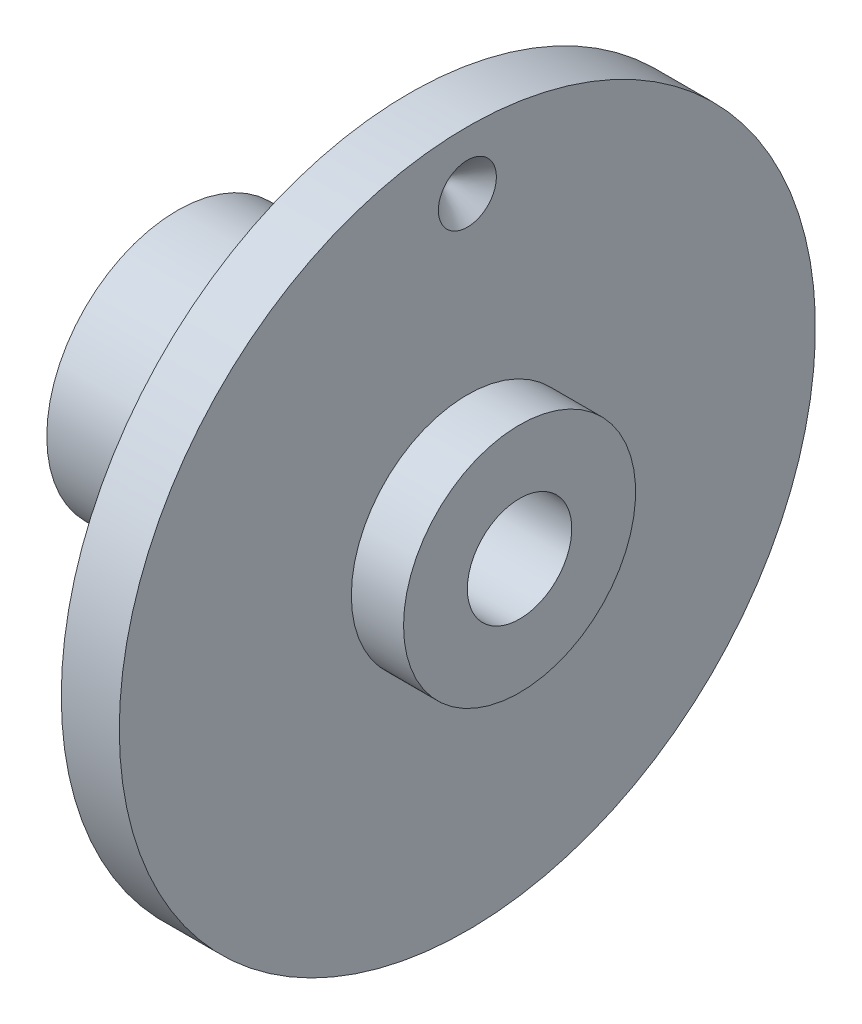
ISO-10303-21;
HEADER;
FILE_DESCRIPTION(('STEP AP214'),'2;1');
FILE_NAME('part.step','',(''),(''),'','','');
FILE_SCHEMA(('AUTOMOTIVE_DESIGN { 1 0 10303 214 1 1 1 1 }'));
ENDSEC;
DATA;
#1=APPLICATION_CONTEXT('core data for automotive mechanical design processes');
#2=APPLICATION_PROTOCOL_DEFINITION('international standard','automotive_design',2000,#1);
#3=PRODUCT_CONTEXT('',#1,'mechanical');
#4=PRODUCT('Part','Part','',(#3));
#5=PRODUCT_RELATED_PRODUCT_CATEGORY('part','',(#4));
#6=PRODUCT_DEFINITION_FORMATION('','',#4);
#7=PRODUCT_DEFINITION_CONTEXT('part definition',#1,'design');
#8=PRODUCT_DEFINITION('design','',#6,#7);
#9=PRODUCT_DEFINITION_SHAPE('','',#8);
#10=(LENGTH_UNIT() NAMED_UNIT(*) SI_UNIT(.MILLI.,.METRE.));
#11=(NAMED_UNIT(*) PLANE_ANGLE_UNIT() SI_UNIT($,.RADIAN.));
#12=(NAMED_UNIT(*) SI_UNIT($,.STERADIAN.) SOLID_ANGLE_UNIT());
#13=UNCERTAINTY_MEASURE_WITH_UNIT(LENGTH_MEASURE(1.E-05),#10,'distance_accuracy_value','');
#14=(GEOMETRIC_REPRESENTATION_CONTEXT(3) GLOBAL_UNCERTAINTY_ASSIGNED_CONTEXT((#13)) GLOBAL_UNIT_ASSIGNED_CONTEXT((#10,
#11,#12)) REPRESENTATION_CONTEXT('',''));
#15=CARTESIAN_POINT('',(0.,0.,0.));
#16=DIRECTION('',(0.,0.,1.));
#17=DIRECTION('',(1.,0.,0.));
#18=AXIS2_PLACEMENT_3D('',#15,#16,#17);
#19=CARTESIAN_POINT('',(50.,20.,0.));
#20=DIRECTION('',(-1.,0.,0.));
#21=DIRECTION('',(0.,0.,1.));
#22=AXIS2_PLACEMENT_3D('',#19,#20,#21);
#23=PLANE('',#22);
#24=CARTESIAN_POINT('',(50.,0.,0.));
#25=DIRECTION('',(-1.,0.,0.));
#26=DIRECTION('',(0.,0.,1.));
#27=AXIS2_PLACEMENT_3D('',#24,#25,#26);
#28=CIRCLE('',#27,20.);
#29=CARTESIAN_POINT('',(50.,0.,20.));
#30=VERTEX_POINT('',#29);
#31=EDGE_CURVE('E76',#30,#30,#28,.T.);
#32=ORIENTED_EDGE('',*,*,#31,.T.);
#33=EDGE_LOOP('',(#32));
#34=FACE_BOUND('',#33,.T.);
#35=CARTESIAN_POINT('',(50.,0.,0.));
#36=DIRECTION('',(-1.,0.,0.));
#37=DIRECTION('',(0.,0.,1.));
#38=AXIS2_PLACEMENT_3D('',#35,#36,#37);
#39=CIRCLE('',#38,60.);
#40=CARTESIAN_POINT('',(50.,0.,60.));
#41=VERTEX_POINT('',#40);
#42=EDGE_CURVE('E79',#41,#41,#39,.T.);
#43=ORIENTED_EDGE('',*,*,#42,.F.);
#44=EDGE_LOOP('',(#43));
#45=FACE_BOUND('',#44,.T.);
#46=CARTESIAN_POINT('',(50.,50.,0.));
#47=DIRECTION('',(-1.,0.,0.));
#48=DIRECTION('',(0.,0.,1.));
#49=AXIS2_PLACEMENT_3D('',#46,#47,#48);
#50=CIRCLE('',#49,5.00000000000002);
#51=CARTESIAN_POINT('',(50.,50.,5.00000000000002));
#52=VERTEX_POINT('',#51);
#53=EDGE_CURVE('E56',#52,#52,#50,.T.);
#54=ORIENTED_EDGE('',*,*,#53,.T.);
#55=EDGE_LOOP('',(#54));
#56=FACE_BOUND('',#55,.T.);
#57=ADVANCED_FACE('F32',(#34,#45,#56),#23,.F.);
#58=CARTESIAN_POINT('',(0.,22.5,0.));
#59=DIRECTION('',(1.,0.,0.));
#60=DIRECTION('',(0.,0.,-1.));
#61=AXIS2_PLACEMENT_3D('',#58,#59,#60);
#62=PLANE('',#61);
#63=CARTESIAN_POINT('',(0.,0.,0.));
#64=DIRECTION('',(-1.,0.,0.));
#65=DIRECTION('',(0.,0.,1.));
#66=AXIS2_PLACEMENT_3D('',#63,#64,#65);
#67=CIRCLE('',#66,9.);
#68=CARTESIAN_POINT('',(0.,0.,9.));
#69=VERTEX_POINT('',#68);
#70=EDGE_CURVE('E58',#69,#69,#67,.T.);
#71=ORIENTED_EDGE('',*,*,#70,.F.);
#72=EDGE_LOOP('',(#71));
#73=FACE_BOUND('',#72,.T.);
#74=CARTESIAN_POINT('',(0.,0.,0.));
#75=DIRECTION('',(-1.,0.,0.));
#76=DIRECTION('',(0.,0.,1.));
#77=AXIS2_PLACEMENT_3D('',#74,#75,#76);
#78=CIRCLE('',#77,22.5);
#79=CARTESIAN_POINT('',(0.,0.,22.5));
#80=VERTEX_POINT('',#79);
#81=EDGE_CURVE('E11',#80,#80,#78,.T.);
#82=ORIENTED_EDGE('',*,*,#81,.T.);
#83=EDGE_LOOP('',(#82));
#84=FACE_BOUND('',#83,.T.);
#85=ADVANCED_FACE('F34',(#73,#84),#62,.F.);
#86=CARTESIAN_POINT('',(-20.,0.,0.));
#87=DIRECTION('',(-1.,0.,0.));
#88=DIRECTION('',(0.,0.,1.));
#89=AXIS2_PLACEMENT_3D('',#86,#87,#88);
#90=CYLINDRICAL_SURFACE('',#89,22.5);
#91=CARTESIAN_POINT('',(15.,13.0770155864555,-18.3096057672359));
#92=CARTESIAN_POINT('',(15.206317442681,13.0770240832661,-18.3096024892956));
#93=CARTESIAN_POINT('',(15.4127485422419,13.0913156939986,-18.2994183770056));
#94=CARTESIAN_POINT('',(15.8198215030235,13.1479095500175,-18.2587962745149));
#95=CARTESIAN_POINT('',(16.0204578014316,13.1902378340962,-18.2283394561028));
#96=CARTESIAN_POINT('',(16.4099908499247,13.3010860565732,-18.1476108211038));
#97=CARTESIAN_POINT('',(16.5988971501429,13.3695843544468,-18.0973553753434));
#98=CARTESIAN_POINT('',(16.9599180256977,13.5300092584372,-17.9777310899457));
#99=CARTESIAN_POINT('',(17.1320345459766,13.6219331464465,-17.9083644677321));
#100=CARTESIAN_POINT('',(17.456263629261,13.8265960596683,-17.750831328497));
#101=CARTESIAN_POINT('',(17.608191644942,13.9395071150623,-17.6625084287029));
#102=CARTESIAN_POINT('',(17.8861286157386,14.1814786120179,-17.4688189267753));
#103=CARTESIAN_POINT('',(18.0121360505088,14.3105400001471,-17.3634513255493));
#104=CARTESIAN_POINT('',(18.2353460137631,14.581076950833,-17.1369033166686));
#105=CARTESIAN_POINT('',(18.3323770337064,14.7226202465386,-17.0156346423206));
#106=CARTESIAN_POINT('',(18.4937776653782,15.0126327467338,-16.7603143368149));
#107=CARTESIAN_POINT('',(18.5581493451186,15.1611015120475,-16.6262635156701));
#108=CARTESIAN_POINT('',(18.6518402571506,15.4587399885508,-16.3498689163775));
#109=CARTESIAN_POINT('',(18.6814694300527,15.6078913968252,-16.2076105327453));
#110=CARTESIAN_POINT('',(18.7057978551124,15.9036103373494,-15.9175394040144));
#111=CARTESIAN_POINT('',(18.7004994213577,16.0501780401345,-15.769727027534));
#112=CARTESIAN_POINT('',(18.6553651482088,16.335150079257,-15.4743208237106));
#113=CARTESIAN_POINT('',(18.6158628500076,16.4736195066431,-15.3267386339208));
#114=CARTESIAN_POINT('',(18.5039671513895,16.7403955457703,-15.0349017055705));
#115=CARTESIAN_POINT('',(18.4315727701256,16.8687018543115,-14.8906470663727));
#116=CARTESIAN_POINT('',(18.2556150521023,17.1128168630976,-14.6094611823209));
#117=CARTESIAN_POINT('',(18.151913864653,17.2285671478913,-14.4725655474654));
#118=CARTESIAN_POINT('',(17.916387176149,17.4446469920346,-14.2113710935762));
#119=CARTESIAN_POINT('',(17.7845594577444,17.544975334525,-14.0870732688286));
#120=CARTESIAN_POINT('',(17.4946707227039,17.7295824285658,-13.8540358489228));
#121=CARTESIAN_POINT('',(17.3363182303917,17.8136576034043,-13.745497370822));
#122=CARTESIAN_POINT('',(16.9988582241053,17.9629552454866,-13.5498130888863));
#123=CARTESIAN_POINT('',(16.8197505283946,18.0281775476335,-13.4626674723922));
#124=CARTESIAN_POINT('',(16.4455371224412,18.138885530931,-13.3131340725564));
#125=CARTESIAN_POINT('',(16.2504145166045,18.1843500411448,-13.2507728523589));
#126=CARTESIAN_POINT('',(15.8498914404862,18.2547937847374,-13.1535600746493));
#127=CARTESIAN_POINT('',(15.6444918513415,18.2797747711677,-13.1187061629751));
#128=CARTESIAN_POINT('',(15.2318037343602,18.3087352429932,-13.0782580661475));
#129=CARTESIAN_POINT('',(15.0245649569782,18.3129555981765,-13.07232830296));
#130=CARTESIAN_POINT('',(14.6118467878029,18.300989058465,-13.0890756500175));
#131=CARTESIAN_POINT('',(14.4063673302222,18.2848029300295,-13.1117516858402));
#132=CARTESIAN_POINT('',(14.0042909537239,18.2324112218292,-13.1845041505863));
#133=CARTESIAN_POINT('',(13.8076472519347,18.1963291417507,-13.2344115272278));
#134=CARTESIAN_POINT('',(13.4273408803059,18.1047212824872,-13.3594550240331));
#135=CARTESIAN_POINT('',(13.2436789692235,18.0491943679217,-13.4345926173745));
#136=CARTESIAN_POINT('',(12.8927337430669,17.918874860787,-13.6079293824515));
#137=CARTESIAN_POINT('',(12.7256124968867,17.8439135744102,-13.7063297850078));
#138=CARTESIAN_POINT('',(12.4141667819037,17.6760719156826,-13.9221090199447));
#139=CARTESIAN_POINT('',(12.2698438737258,17.5831903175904,-14.0394891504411));
#140=CARTESIAN_POINT('',(12.006606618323,17.3799857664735,-14.2902888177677));
#141=CARTESIAN_POINT('',(11.8879638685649,17.2694959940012,-14.423858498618));
#142=CARTESIAN_POINT('',(11.6813557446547,17.0338530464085,-14.7013924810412));
#143=CARTESIAN_POINT('',(11.5933893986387,16.9087003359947,-14.8453564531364));
#144=CARTESIAN_POINT('',(11.4510553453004,16.6470296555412,-15.1381887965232));
#145=CARTESIAN_POINT('',(11.3965446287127,16.5105629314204,-15.2870333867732));
#146=CARTESIAN_POINT('',(11.3222083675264,16.229201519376,-15.585411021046));
#147=CARTESIAN_POINT('',(11.3023800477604,16.084307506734,-15.7349440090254));
#148=CARTESIAN_POINT('',(11.2980496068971,15.791859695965,-16.0283991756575));
#149=CARTESIAN_POINT('',(11.3131339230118,15.6443573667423,-16.1723667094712));
#150=CARTESIAN_POINT('',(11.3773071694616,15.3494116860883,-16.4525666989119));
#151=CARTESIAN_POINT('',(11.4263959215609,15.2019683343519,-16.5887991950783));
#152=CARTESIAN_POINT('',(11.5570275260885,14.9119016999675,-16.8500230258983));
#153=CARTESIAN_POINT('',(11.6385361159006,14.7692735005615,-16.9750260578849));
#154=CARTESIAN_POINT('',(11.8316479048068,14.4932937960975,-17.2112600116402));
#155=CARTESIAN_POINT('',(11.9432524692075,14.359942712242,-17.3224903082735));
#156=CARTESIAN_POINT('',(12.1948583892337,14.1055852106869,-17.530253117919));
#157=CARTESIAN_POINT('',(12.335162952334,13.9847332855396,-17.6266076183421));
#158=CARTESIAN_POINT('',(12.6395494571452,13.7614013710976,-17.8015169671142));
#159=CARTESIAN_POINT('',(12.8036369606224,13.6589256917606,-17.8800676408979));
#160=CARTESIAN_POINT('',(13.1522675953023,13.4756120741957,-18.0186351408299));
#161=CARTESIAN_POINT('',(13.3369434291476,13.394927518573,-18.0785210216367));
#162=CARTESIAN_POINT('',(13.7205354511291,13.2594608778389,-18.1781139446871));
#163=CARTESIAN_POINT('',(13.9194371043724,13.2046527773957,-18.2178412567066));
#164=CARTESIAN_POINT('',(14.2659419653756,13.1351466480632,-18.2679810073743));
#165=CARTESIAN_POINT('',(14.4114409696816,13.1133944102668,-18.2835775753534));
#166=CARTESIAN_POINT('',(14.704607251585,13.0843259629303,-18.3043910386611));
#167=CARTESIAN_POINT('',(14.8522744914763,13.0770095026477,-18.3096081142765));
#168=CARTESIAN_POINT('',(15.,13.0770155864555,-18.3096057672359));
#169=B_SPLINE_CURVE_WITH_KNOTS('',3,(#91,#92,#93,#94,#95,#96,#97,#98,#99,#100,#101,#102,#103,
#104,#105,#106,#107,#108,#109,#110,#111,#112,#113,#114,#115,#116,#117,#118,#119,#120,#121,#122,
#123,#124,#125,#126,#127,#128,#129,#130,#131,#132,#133,#134,#135,#136,#137,#138,#139,#140,#141,
#142,#143,#144,#145,#146,#147,#148,#149,#150,#151,#152,#153,#154,#155,#156,#157,#158,#159,#160,
#161,#162,#163,#164,#165,#166,#167,#168),.UNSPECIFIED.,.T.,.F.,(4,2,2,2,2,2,2,2,2,2,2,2,2,2,2,2,
2,2,2,2,2,2,2,2,2,2,2,2,2,2,2,2,2,2,2,2,2,2,4),(0.,0.618412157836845,1.23739946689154,
1.85587602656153,2.47428085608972,3.09799813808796,3.72175199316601,4.34912776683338,
4.97646380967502,5.59815970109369,6.21981440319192,6.83547441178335,7.45115278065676,
8.06958266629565,8.68806132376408,9.3138454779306,9.93963511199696,10.5660936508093,
11.1924985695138,11.8116183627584,12.4307149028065,13.0460111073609,13.661343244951,
14.2822066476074,14.9031125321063,15.5302950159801,16.1574576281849,16.7819203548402,
17.4063331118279,18.0233872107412,18.6404380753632,19.2568385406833,19.873266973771,
20.4965794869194,21.1200380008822,21.7477768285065,22.3748831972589,22.8176806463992,
23.2604704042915),.UNSPECIFIED.);
#170=CARTESIAN_POINT('',(15.,13.0770155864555,-18.3096057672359));
#171=VERTEX_POINT('',#170);
#172=EDGE_CURVE('E59',#171,#171,#169,.T.);
#173=ORIENTED_EDGE('',*,*,#172,.T.);
#174=EDGE_LOOP('',(#173));
#175=FACE_BOUND('',#174,.T.);
#176=CARTESIAN_POINT('',(15.,-18.309605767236,13.0770155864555));
#177=CARTESIAN_POINT('',(14.793682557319,-18.3096024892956,13.0770240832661));
#178=CARTESIAN_POINT('',(14.587251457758,-18.2994183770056,13.0913156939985));
#179=CARTESIAN_POINT('',(14.1801784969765,-18.258796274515,13.1479095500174));
#180=CARTESIAN_POINT('',(13.9795421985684,-18.2283394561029,13.1902378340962));
#181=CARTESIAN_POINT('',(13.5900091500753,-18.1476108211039,13.3010860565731));
#182=CARTESIAN_POINT('',(13.4011028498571,-18.0973553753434,13.3695843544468));
#183=CARTESIAN_POINT('',(13.0400819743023,-17.9777310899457,13.5300092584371));
#184=CARTESIAN_POINT('',(12.8679654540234,-17.9083644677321,13.6219331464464));
#185=CARTESIAN_POINT('',(12.543736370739,-17.7508313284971,13.8265960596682));
#186=CARTESIAN_POINT('',(12.391808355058,-17.6625084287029,13.9395071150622));
#187=CARTESIAN_POINT('',(12.1138713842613,-17.4688189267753,14.1814786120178));
#188=CARTESIAN_POINT('',(11.9878639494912,-17.3634513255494,14.3105400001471));
#189=CARTESIAN_POINT('',(11.7646539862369,-17.1369033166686,14.581076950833));
#190=CARTESIAN_POINT('',(11.6676229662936,-17.0156346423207,14.7226202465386));
#191=CARTESIAN_POINT('',(11.5062223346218,-16.760314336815,15.0126327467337));
#192=CARTESIAN_POINT('',(11.4418506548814,-16.6262635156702,15.1611015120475));
#193=CARTESIAN_POINT('',(11.3481597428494,-16.3498689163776,15.4587399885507));
#194=CARTESIAN_POINT('',(11.3185305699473,-16.2076105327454,15.6078913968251));
#195=CARTESIAN_POINT('',(11.2942021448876,-15.9175394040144,15.9036103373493));
#196=CARTESIAN_POINT('',(11.2995005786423,-15.7697270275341,16.0501780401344));
#197=CARTESIAN_POINT('',(11.3446348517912,-15.4743208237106,16.3351500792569));
#198=CARTESIAN_POINT('',(11.3841371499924,-15.3267386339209,16.473619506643));
#199=CARTESIAN_POINT('',(11.4960328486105,-15.0349017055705,16.7403955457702));
#200=CARTESIAN_POINT('',(11.5684272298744,-14.8906470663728,16.8687018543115));
#201=CARTESIAN_POINT('',(11.7443849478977,-14.6094611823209,17.1128168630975));
#202=CARTESIAN_POINT('',(11.848086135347,-14.4725655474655,17.2285671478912));
#203=CARTESIAN_POINT('',(12.083612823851,-14.2113710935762,17.4446469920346));
#204=CARTESIAN_POINT('',(12.2154405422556,-14.0870732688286,17.5449753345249));
#205=CARTESIAN_POINT('',(12.5053292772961,-13.8540358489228,17.7295824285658));
#206=CARTESIAN_POINT('',(12.6636817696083,-13.745497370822,17.8136576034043));
#207=CARTESIAN_POINT('',(13.0011417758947,-13.5498130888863,17.9629552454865));
#208=CARTESIAN_POINT('',(13.1802494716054,-13.4626674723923,18.0281775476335));
#209=CARTESIAN_POINT('',(13.5544628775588,-13.3131340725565,18.138885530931));
#210=CARTESIAN_POINT('',(13.7495854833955,-13.250772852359,18.1843500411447));
#211=CARTESIAN_POINT('',(14.1501085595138,-13.1535600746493,18.2547937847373));
#212=CARTESIAN_POINT('',(14.3555081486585,-13.1187061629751,18.2797747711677));
#213=CARTESIAN_POINT('',(14.7681962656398,-13.0782580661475,18.3087352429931));
#214=CARTESIAN_POINT('',(14.9754350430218,-13.0723283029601,18.3129555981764));
#215=CARTESIAN_POINT('',(15.3881532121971,-13.0890756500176,18.3009890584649));
#216=CARTESIAN_POINT('',(15.5936326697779,-13.1117516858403,18.2848029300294));
#217=CARTESIAN_POINT('',(15.9957090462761,-13.1845041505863,18.2324112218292));
#218=CARTESIAN_POINT('',(16.1923527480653,-13.2344115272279,18.1963291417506));
#219=CARTESIAN_POINT('',(16.5726591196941,-13.3594550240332,18.1047212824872));
#220=CARTESIAN_POINT('',(16.7563210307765,-13.4345926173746,18.0491943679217));
#221=CARTESIAN_POINT('',(17.1072662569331,-13.6079293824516,17.918874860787));
#222=CARTESIAN_POINT('',(17.2743875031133,-13.7063297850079,17.8439135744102));
#223=CARTESIAN_POINT('',(17.5858332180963,-13.9221090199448,17.6760719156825));
#224=CARTESIAN_POINT('',(17.7301561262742,-14.0394891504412,17.5831903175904));
#225=CARTESIAN_POINT('',(17.993393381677,-14.2902888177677,17.3799857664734));
#226=CARTESIAN_POINT('',(18.1120361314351,-14.4238584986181,17.2694959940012));
#227=CARTESIAN_POINT('',(18.3186442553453,-14.7013924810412,17.0338530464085));
#228=CARTESIAN_POINT('',(18.4066106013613,-14.8453564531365,16.9087003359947));
#229=CARTESIAN_POINT('',(18.5489446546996,-15.1381887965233,16.6470296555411));
#230=CARTESIAN_POINT('',(18.6034553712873,-15.2870333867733,16.5105629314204));
#231=CARTESIAN_POINT('',(18.6777916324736,-15.5854110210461,16.2292015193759));
#232=CARTESIAN_POINT('',(18.6976199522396,-15.7349440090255,16.0843075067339));
#233=CARTESIAN_POINT('',(18.7019503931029,-16.0283991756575,15.7918596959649));
#234=CARTESIAN_POINT('',(18.6868660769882,-16.1723667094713,15.6443573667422));
#235=CARTESIAN_POINT('',(18.6226928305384,-16.452566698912,15.3494116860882));
#236=CARTESIAN_POINT('',(18.5736040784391,-16.5887991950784,15.2019683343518));
#237=CARTESIAN_POINT('',(18.4429724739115,-16.8500230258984,14.9119016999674));
#238=CARTESIAN_POINT('',(18.3614638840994,-16.975026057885,14.7692735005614));
#239=CARTESIAN_POINT('',(18.1683520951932,-17.2112600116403,14.4932937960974));
#240=CARTESIAN_POINT('',(18.0567475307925,-17.3224903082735,14.359942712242));
#241=CARTESIAN_POINT('',(17.8051416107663,-17.530253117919,14.1055852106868));
#242=CARTESIAN_POINT('',(17.664837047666,-17.6266076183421,13.9847332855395));
#243=CARTESIAN_POINT('',(17.3604505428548,-17.8015169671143,13.7614013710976));
#244=CARTESIAN_POINT('',(17.1963630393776,-17.8800676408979,13.6589256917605));
#245=CARTESIAN_POINT('',(16.8477324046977,-18.0186351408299,13.4756120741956));
#246=CARTESIAN_POINT('',(16.6630565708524,-18.0785210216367,13.3949275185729));
#247=CARTESIAN_POINT('',(16.2794645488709,-18.1781139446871,13.2594608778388));
#248=CARTESIAN_POINT('',(16.0805628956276,-18.2178412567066,13.2046527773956));
#249=CARTESIAN_POINT('',(15.7340580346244,-18.2679810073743,13.1351466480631));
#250=CARTESIAN_POINT('',(15.5885590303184,-18.2835775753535,13.1133944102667));
#251=CARTESIAN_POINT('',(15.295392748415,-18.3043910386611,13.0843259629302));
#252=CARTESIAN_POINT('',(15.1477255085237,-18.3096081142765,13.0770095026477));
#253=CARTESIAN_POINT('',(15.,-18.309605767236,13.0770155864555));
#254=B_SPLINE_CURVE_WITH_KNOTS('',3,(#176,#177,#178,#179,#180,#181,#182,#183,#184,#185,#186,
#187,#188,#189,#190,#191,#192,#193,#194,#195,#196,#197,#198,#199,#200,#201,#202,#203,#204,#205,
#206,#207,#208,#209,#210,#211,#212,#213,#214,#215,#216,#217,#218,#219,#220,#221,#222,#223,#224,
#225,#226,#227,#228,#229,#230,#231,#232,#233,#234,#235,#236,#237,#238,#239,#240,#241,#242,#243,
#244,#245,#246,#247,#248,#249,#250,#251,#252,#253),.UNSPECIFIED.,.T.,.F.,(4,2,2,2,2,2,2,2,2,2,2,
2,2,2,2,2,2,2,2,2,2,2,2,2,2,2,2,2,2,2,2,2,2,2,2,2,2,2,4),(0.,0.618412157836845,1.23739946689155,
1.85587602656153,2.47428085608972,3.09799813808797,3.72175199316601,4.34912776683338,
4.97646380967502,5.59815970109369,6.21981440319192,6.83547441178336,7.45115278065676,
8.06958266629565,8.68806132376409,9.31384547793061,9.93963511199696,10.5660936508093,
11.1924985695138,11.8116183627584,12.4307149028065,13.0460111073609,13.661343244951,
14.2822066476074,14.9031125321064,15.5302950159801,16.1574576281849,16.7819203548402,
17.4063331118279,18.0233872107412,18.6404380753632,19.2568385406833,19.873266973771,
20.4965794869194,21.1200380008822,21.7477768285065,22.3748831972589,22.8176806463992,
23.2604704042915),.UNSPECIFIED.);
#255=CARTESIAN_POINT('',(15.,-18.309605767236,13.0770155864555));
#256=VERTEX_POINT('',#255);
#257=EDGE_CURVE('E65',#256,#256,#254,.T.);
#258=ORIENTED_EDGE('',*,*,#257,.T.);
#259=EDGE_LOOP('',(#258));
#260=FACE_BOUND('',#259,.T.);
#261=ORIENTED_EDGE('',*,*,#81,.F.);
#262=EDGE_LOOP('',(#261));
#263=FACE_BOUND('',#262,.T.);
#264=CARTESIAN_POINT('',(40.,0.,0.));
#265=DIRECTION('',(-1.,0.,0.));
#266=DIRECTION('',(0.,0.,1.));
#267=AXIS2_PLACEMENT_3D('',#264,#265,#266);
#268=CIRCLE('',#267,22.5);
#269=CARTESIAN_POINT('',(40.,0.,22.5));
#270=VERTEX_POINT('',#269);
#271=EDGE_CURVE('E44',#270,#270,#268,.T.);
#272=ORIENTED_EDGE('',*,*,#271,.T.);
#273=EDGE_LOOP('',(#272));
#274=FACE_BOUND('',#273,.T.);
#275=ADVANCED_FACE('F102',(#175,#260,#263,#274),#90,.T.);
#276=CARTESIAN_POINT('',(40.,60.,0.));
#277=DIRECTION('',(1.,0.,0.));
#278=DIRECTION('',(0.,0.,-1.));
#279=AXIS2_PLACEMENT_3D('',#276,#277,#278);
#280=PLANE('',#279);
#281=ORIENTED_EDGE('',*,*,#271,.F.);
#282=EDGE_LOOP('',(#281));
#283=FACE_BOUND('',#282,.T.);
#284=CARTESIAN_POINT('',(40.,0.,0.));
#285=DIRECTION('',(-1.,0.,0.));
#286=DIRECTION('',(0.,0.,1.));
#287=AXIS2_PLACEMENT_3D('',#284,#285,#286);
#288=CIRCLE('',#287,60.);
#289=CARTESIAN_POINT('',(40.,0.,60.));
#290=VERTEX_POINT('',#289);
#291=EDGE_CURVE('E82',#290,#290,#288,.T.);
#292=ORIENTED_EDGE('',*,*,#291,.T.);
#293=EDGE_LOOP('',(#292));
#294=FACE_BOUND('',#293,.T.);
#295=ADVANCED_FACE('F106',(#283,#294),#280,.F.);
#296=CARTESIAN_POINT('',(-20.,0.,0.));
#297=DIRECTION('',(-1.,0.,0.));
#298=DIRECTION('',(0.,0.,1.));
#299=AXIS2_PLACEMENT_3D('',#296,#297,#298);
#300=CYLINDRICAL_SURFACE('',#299,60.);
#301=ORIENTED_EDGE('',*,*,#291,.F.);
#302=EDGE_LOOP('',(#301));
#303=FACE_BOUND('',#302,.T.);
#304=ORIENTED_EDGE('',*,*,#42,.T.);
#305=EDGE_LOOP('',(#304));
#306=FACE_BOUND('',#305,.T.);
#307=ADVANCED_FACE('F111',(#303,#306),#300,.T.);
#308=CARTESIAN_POINT('',(-20.,0.,0.));
#309=DIRECTION('',(-1.,0.,0.));
#310=DIRECTION('',(0.,0.,1.));
#311=AXIS2_PLACEMENT_3D('',#308,#309,#310);
#312=CYLINDRICAL_SURFACE('',#311,20.);
#313=ORIENTED_EDGE('',*,*,#31,.F.);
#314=EDGE_LOOP('',(#313));
#315=FACE_BOUND('',#314,.T.);
#316=CARTESIAN_POINT('',(59.,0.,0.));
#317=DIRECTION('',(-1.,0.,0.));
#318=DIRECTION('',(0.,0.,1.));
#319=AXIS2_PLACEMENT_3D('',#316,#317,#318);
#320=CIRCLE('',#319,20.);
#321=CARTESIAN_POINT('',(59.,0.,20.));
#322=VERTEX_POINT('',#321);
#323=EDGE_CURVE('E73',#322,#322,#320,.T.);
#324=ORIENTED_EDGE('',*,*,#323,.T.);
#325=EDGE_LOOP('',(#324));
#326=FACE_BOUND('',#325,.T.);
#327=ADVANCED_FACE('F115',(#315,#326),#312,.T.);
#328=CARTESIAN_POINT('',(59.,9.,0.));
#329=DIRECTION('',(-1.,0.,0.));
#330=DIRECTION('',(0.,0.,1.));
#331=AXIS2_PLACEMENT_3D('',#328,#329,#330);
#332=PLANE('',#331);
#333=ORIENTED_EDGE('',*,*,#323,.F.);
#334=EDGE_LOOP('',(#333));
#335=FACE_BOUND('',#334,.T.);
#336=CARTESIAN_POINT('',(59.,0.,0.));
#337=DIRECTION('',(-1.,0.,0.));
#338=DIRECTION('',(0.,0.,1.));
#339=AXIS2_PLACEMENT_3D('',#336,#337,#338);
#340=CIRCLE('',#339,9.);
#341=CARTESIAN_POINT('',(59.,0.,9.));
#342=VERTEX_POINT('',#341);
#343=EDGE_CURVE('E62',#342,#342,#340,.T.);
#344=ORIENTED_EDGE('',*,*,#343,.T.);
#345=EDGE_LOOP('',(#344));
#346=FACE_BOUND('',#345,.T.);
#347=ADVANCED_FACE('F121',(#335,#346),#332,.F.);
#348=CARTESIAN_POINT('',(-20.,0.,0.));
#349=DIRECTION('',(-1.,0.,0.));
#350=DIRECTION('',(0.,0.,1.));
#351=AXIS2_PLACEMENT_3D('',#348,#349,#350);
#352=CYLINDRICAL_SURFACE('',#351,9.);
#353=CARTESIAN_POINT('',(15.,3.18499786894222,-8.41758804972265));
#354=CARTESIAN_POINT('',(14.9011475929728,3.18499882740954,-8.41758805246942));
#355=CARTESIAN_POINT('',(14.8022582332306,3.18907108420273,-8.41605034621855));
#356=CARTESIAN_POINT('',(14.605197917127,3.20528953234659,-8.40988654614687));
#357=CARTESIAN_POINT('',(14.5070274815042,3.2174410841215,-8.40525840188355));
#358=CARTESIAN_POINT('',(14.3119639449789,3.24963804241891,-8.39286314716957));
#359=CARTESIAN_POINT('',(14.2150740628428,3.26970045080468,-8.38508927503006));
#360=CARTESIAN_POINT('',(14.0234684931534,3.31736038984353,-8.36634736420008));
#361=CARTESIAN_POINT('',(13.9287537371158,3.34496108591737,-8.35537798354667));
#362=CARTESIAN_POINT('',(13.6496679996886,3.43815509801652,-8.31766887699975));
#363=CARTESIAN_POINT('',(13.469348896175,3.51431279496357,-8.28606648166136));
#364=CARTESIAN_POINT('',(13.1242006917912,3.69044636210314,-8.20912813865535));
#365=CARTESIAN_POINT('',(12.9593676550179,3.79041615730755,-8.16379569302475));
#366=CARTESIAN_POINT('',(12.6396650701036,4.01561570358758,-8.05551095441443));
#367=CARTESIAN_POINT('',(12.4858391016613,4.14193080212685,-7.99172806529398));
#368=CARTESIAN_POINT('',(12.2021502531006,4.41053240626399,-7.84668640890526));
#369=CARTESIAN_POINT('',(12.0722964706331,4.55282494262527,-7.76542103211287));
#370=CARTESIAN_POINT('',(11.8349497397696,4.8540830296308,-7.58091830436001));
#371=CARTESIAN_POINT('',(11.7286259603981,5.0134979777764,-7.4769010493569));
#372=CARTESIAN_POINT('',(11.5492739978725,5.33712587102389,-7.24942184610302));
#373=CARTESIAN_POINT('',(11.4762314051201,5.50133670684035,-7.1259683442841));
#374=CARTESIAN_POINT('',(11.3692817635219,5.81952180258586,-6.86825463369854));
#375=CARTESIAN_POINT('',(11.3335744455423,5.97359217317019,-6.73486249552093));
#376=CARTESIAN_POINT('',(11.2964988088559,6.27433823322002,-6.45559620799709));
#377=CARTESIAN_POINT('',(11.2951169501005,6.42101681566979,-6.30972700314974));
#378=CARTESIAN_POINT('',(11.3257733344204,6.69383080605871,-6.01913798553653));
#379=CARTESIAN_POINT('',(11.355835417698,6.8206685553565,-5.87486257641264));
#380=CARTESIAN_POINT('',(11.4451476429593,7.06071995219,-5.58406639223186));
#381=CARTESIAN_POINT('',(11.5043999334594,7.17393259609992,-5.43754545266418));
#382=CARTESIAN_POINT('',(11.6511241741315,7.38671494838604,-5.14487163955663));
#383=CARTESIAN_POINT('',(11.7390116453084,7.48605095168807,-4.99875826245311));
#384=CARTESIAN_POINT('',(11.9401105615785,7.66853487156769,-4.71404403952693));
#385=CARTESIAN_POINT('',(12.0533308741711,7.75167710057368,-4.57544584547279));
#386=CARTESIAN_POINT('',(12.3109569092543,7.90727685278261,-4.30133692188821));
#387=CARTESIAN_POINT('',(12.4569734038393,7.97860410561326,-4.16669627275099));
#388=CARTESIAN_POINT('',(12.7714840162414,8.10412330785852,-3.9169835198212));
#389=CARTESIAN_POINT('',(12.9399863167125,8.15830899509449,-3.80191857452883));
#390=CARTESIAN_POINT('',(13.3013600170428,8.25214691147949,-3.59382018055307));
#391=CARTESIAN_POINT('',(13.494828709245,8.29129165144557,-3.50158824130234));
#392=CARTESIAN_POINT('',(13.896617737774,8.3537019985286,-3.34999451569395));
#393=CARTESIAN_POINT('',(14.1049276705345,8.37697861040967,-3.29060995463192));
#394=CARTESIAN_POINT('',(14.5163318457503,8.40746617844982,-3.21188331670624));
#395=CARTESIAN_POINT('',(14.7189144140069,8.41560524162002,-3.19023354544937));
#396=CARTESIAN_POINT('',(15.1249009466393,8.41893085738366,-3.18145338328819));
#397=CARTESIAN_POINT('',(15.3283046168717,8.41412169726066,-3.19431156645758));
#398=CARTESIAN_POINT('',(15.7169675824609,8.39211245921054,-3.2516565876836));
#399=CARTESIAN_POINT('',(15.9025727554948,8.37569388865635,-3.29414636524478));
#400=CARTESIAN_POINT('',(16.2640170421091,8.33089197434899,-3.40585280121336));
#401=CARTESIAN_POINT('',(16.4398539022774,8.30250588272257,-3.47507559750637));
#402=CARTESIAN_POINT('',(16.7849737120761,8.23162735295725,-3.63986984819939));
#403=CARTESIAN_POINT('',(16.9536759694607,8.18859513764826,-3.73642125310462));
#404=CARTESIAN_POINT('',(17.2729201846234,8.08783286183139,-3.94979313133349));
#405=CARTESIAN_POINT('',(17.4234543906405,8.03009655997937,-4.06662220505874));
#406=CARTESIAN_POINT('',(17.7144365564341,7.89377055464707,-4.32567028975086));
#407=CARTESIAN_POINT('',(17.8531535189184,7.81389560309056,-4.46916488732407));
#408=CARTESIAN_POINT('',(18.1024105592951,7.63503688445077,-4.76828524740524));
#409=CARTESIAN_POINT('',(18.2129488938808,7.53605193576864,-4.92391175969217));
#410=CARTESIAN_POINT('',(18.40248697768,7.31880615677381,-5.24138169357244));
#411=CARTESIAN_POINT('',(18.4814371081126,7.20051540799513,-5.40323446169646));
#412=CARTESIAN_POINT('',(18.604335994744,6.94629611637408,-5.72635330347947));
#413=CARTESIAN_POINT('',(18.6483049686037,6.81037781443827,-5.887619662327));
#414=CARTESIAN_POINT('',(18.6974965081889,6.5340596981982,-6.19237179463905));
#415=CARTESIAN_POINT('',(18.7051619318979,6.3946011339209,-6.33631948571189));
#416=CARTESIAN_POINT('',(18.6880569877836,6.10739282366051,-6.61358966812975));
#417=CARTESIAN_POINT('',(18.6632920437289,5.95964446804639,-6.7469139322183));
#418=CARTESIAN_POINT('',(18.5837817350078,5.66591277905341,-6.99522776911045));
#419=CARTESIAN_POINT('',(18.5300793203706,5.52003892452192,-7.11068512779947));
#420=CARTESIAN_POINT('',(18.3953413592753,5.22992701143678,-7.32670495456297));
#421=CARTESIAN_POINT('',(18.3143005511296,5.08568927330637,-7.42726454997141));
#422=CARTESIAN_POINT('',(18.123107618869,4.79717874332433,-7.61696952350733));
#423=CARTESIAN_POINT('',(18.0118114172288,4.65319537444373,-7.70539933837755));
#424=CARTESIAN_POINT('',(17.7649418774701,4.37717830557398,-7.86548217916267));
#425=CARTESIAN_POINT('',(17.6293598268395,4.24514891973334,-7.93712916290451));
#426=CARTESIAN_POINT('',(17.3272520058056,3.9898772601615,-8.06863321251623));
#427=CARTESIAN_POINT('',(17.1592755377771,3.86778806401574,-8.12740166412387));
#428=CARTESIAN_POINT('',(16.8027034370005,3.64880470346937,-8.22805104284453));
#429=CARTESIAN_POINT('',(16.6140965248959,3.55192442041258,-8.26992267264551));
#430=CARTESIAN_POINT('',(16.3202904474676,3.43033426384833,-8.32073925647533));
#431=CARTESIAN_POINT('',(16.2208373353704,3.39382971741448,-8.33565407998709));
#432=CARTESIAN_POINT('',(16.0187930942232,3.32914926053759,-8.36169761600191));
#433=CARTESIAN_POINT('',(15.9162035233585,3.30096928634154,-8.3728281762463));
#434=CARTESIAN_POINT('',(15.7089495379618,3.25354116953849,-8.39137155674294));
#435=CARTESIAN_POINT('',(15.6042913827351,3.23426941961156,-8.39879420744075));
#436=CARTESIAN_POINT('',(15.3935517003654,3.20495042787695,-8.41002632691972));
#437=CARTESIAN_POINT('',(15.2874713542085,3.1948959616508,-8.41383862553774));
#438=CARTESIAN_POINT('',(15.1509995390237,3.1880332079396,-8.41643895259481));
#439=CARTESIAN_POINT('',(15.1208136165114,3.18689538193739,-8.41686986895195));
#440=CARTESIAN_POINT('',(15.0604196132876,3.18537756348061,-8.41744441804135));
#441=CARTESIAN_POINT('',(15.0302115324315,3.18499757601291,-8.41758804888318));
#442=CARTESIAN_POINT('',(15.,3.18499786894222,-8.41758804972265));
#443=B_SPLINE_CURVE_WITH_KNOTS('',3,(#353,#354,#355,#356,#357,#358,#359,#360,#361,#362,#363,
#364,#365,#366,#367,#368,#369,#370,#371,#372,#373,#374,#375,#376,#377,#378,#379,#380,#381,#382,
#383,#384,#385,#386,#387,#388,#389,#390,#391,#392,#393,#394,#395,#396,#397,#398,#399,#400,#401,
#402,#403,#404,#405,#406,#407,#408,#409,#410,#411,#412,#413,#414,#415,#416,#417,#418,#419,#420,
#421,#422,#423,#424,#425,#426,#427,#428,#429,#430,#431,#432,#433,#434,#435,#436,#437,#438,#439,
#440,#441,#442),.UNSPECIFIED.,.T.,.F.,(4,2,2,2,2,2,2,2,2,2,2,2,2,2,2,2,2,2,2,2,2,2,2,2,2,2,2,2,
2,2,2,2,2,2,2,2,2,2,2,2,2,2,2,2,4),(0.,0.296525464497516,0.593247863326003,0.890611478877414,
1.18810015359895,1.7800467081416,2.3718424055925,2.99612295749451,3.62063994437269,
4.27140451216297,4.9218870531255,5.53931113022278,6.15649165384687,6.73708808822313,
7.31772726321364,7.90719812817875,8.49687565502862,9.12716599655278,9.75768633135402,
10.4079246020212,11.0577114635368,11.6661478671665,12.2743828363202,12.8451515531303,
13.4160513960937,14.0108016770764,14.6058048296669,15.247720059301,15.8896749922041,
16.53263438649,17.1752219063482,17.7738895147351,18.372457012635,18.9507679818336,
19.5291903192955,20.133593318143,20.73821358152,21.3826928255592,22.0275262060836,
22.3481242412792,22.6685655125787,22.9881526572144,23.3074890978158,23.3981133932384,
23.4887382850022),.UNSPECIFIED.);
#444=CARTESIAN_POINT('',(15.,3.18499786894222,-8.41758804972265));
#445=VERTEX_POINT('',#444);
#446=EDGE_CURVE('E36',#445,#445,#443,.T.);
#447=ORIENTED_EDGE('',*,*,#446,.T.);
#448=EDGE_LOOP('',(#447));
#449=FACE_BOUND('',#448,.T.);
#450=CARTESIAN_POINT('',(15.,-8.41758804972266,3.18499786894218));
#451=CARTESIAN_POINT('',(15.0988524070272,-8.41758805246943,3.1849988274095));
#452=CARTESIAN_POINT('',(15.1977417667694,-8.41605034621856,3.18907108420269));
#453=CARTESIAN_POINT('',(15.394802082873,-8.40988654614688,3.20528953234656));
#454=CARTESIAN_POINT('',(15.4929725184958,-8.40525840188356,3.21744108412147));
#455=CARTESIAN_POINT('',(15.6880360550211,-8.39286314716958,3.24963804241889));
#456=CARTESIAN_POINT('',(15.7849259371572,-8.38508927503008,3.26970045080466));
#457=CARTESIAN_POINT('',(15.9765315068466,-8.3663473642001,3.31736038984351));
#458=CARTESIAN_POINT('',(16.0712462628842,-8.35537798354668,3.34496108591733));
#459=CARTESIAN_POINT('',(16.3503320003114,-8.31766887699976,3.43815509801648));
#460=CARTESIAN_POINT('',(16.530651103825,-8.28606648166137,3.51431279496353));
#461=CARTESIAN_POINT('',(16.8757993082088,-8.20912813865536,3.69044636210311));
#462=CARTESIAN_POINT('',(17.0406323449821,-8.16379569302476,3.79041615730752));
#463=CARTESIAN_POINT('',(17.3603349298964,-8.05551095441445,4.01561570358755));
#464=CARTESIAN_POINT('',(17.5141608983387,-7.991728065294,4.14193080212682));
#465=CARTESIAN_POINT('',(17.7978497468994,-7.84668640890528,4.41053240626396));
#466=CARTESIAN_POINT('',(17.9277035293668,-7.76542103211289,4.55282494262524));
#467=CARTESIAN_POINT('',(18.1650502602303,-7.58091830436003,4.85408302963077));
#468=CARTESIAN_POINT('',(18.2713740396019,-7.47690104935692,5.01349797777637));
#469=CARTESIAN_POINT('',(18.4507260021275,-7.24942184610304,5.33712587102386));
#470=CARTESIAN_POINT('',(18.5237685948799,-7.12596834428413,5.50133670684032));
#471=CARTESIAN_POINT('',(18.6307182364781,-6.86825463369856,5.81952180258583));
#472=CARTESIAN_POINT('',(18.6664255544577,-6.73486249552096,5.97359217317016));
#473=CARTESIAN_POINT('',(18.7035011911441,-6.45559620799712,6.27433823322));
#474=CARTESIAN_POINT('',(18.7048830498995,-6.30972700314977,6.42101681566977));
#475=CARTESIAN_POINT('',(18.6742266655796,-6.01913798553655,6.69383080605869));
#476=CARTESIAN_POINT('',(18.644164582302,-5.87486257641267,6.82066855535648));
#477=CARTESIAN_POINT('',(18.5548523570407,-5.58406639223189,7.06071995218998));
#478=CARTESIAN_POINT('',(18.4956000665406,-5.4375454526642,7.1739325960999));
#479=CARTESIAN_POINT('',(18.3488758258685,-5.14487163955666,7.38671494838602));
#480=CARTESIAN_POINT('',(18.2609883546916,-4.99875826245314,7.48605095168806));
#481=CARTESIAN_POINT('',(18.0598894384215,-4.71404403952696,7.66853487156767));
#482=CARTESIAN_POINT('',(17.9466691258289,-4.57544584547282,7.75167710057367));
#483=CARTESIAN_POINT('',(17.6890430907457,-4.30133692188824,7.90727685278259));
#484=CARTESIAN_POINT('',(17.5430265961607,-4.16669627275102,7.97860410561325));
#485=CARTESIAN_POINT('',(17.2285159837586,-3.91698351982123,8.1041233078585));
#486=CARTESIAN_POINT('',(17.0600136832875,-3.80191857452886,8.15830899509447));
#487=CARTESIAN_POINT('',(16.6986399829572,-3.59382018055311,8.25214691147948));
#488=CARTESIAN_POINT('',(16.505171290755,-3.50158824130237,8.29129165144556));
#489=CARTESIAN_POINT('',(16.103382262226,-3.34999451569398,8.35370199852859));
#490=CARTESIAN_POINT('',(15.8950723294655,-3.29060995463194,8.37697861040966));
#491=CARTESIAN_POINT('',(15.4836681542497,-3.21188331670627,8.4074661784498));
#492=CARTESIAN_POINT('',(15.281085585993,-3.1902335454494,8.41560524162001));
#493=CARTESIAN_POINT('',(14.8750990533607,-3.18145338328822,8.41893085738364));
#494=CARTESIAN_POINT('',(14.6716953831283,-3.19431156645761,8.41412169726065));
#495=CARTESIAN_POINT('',(14.2830324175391,-3.25165658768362,8.39211245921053));
#496=CARTESIAN_POINT('',(14.0974272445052,-3.29414636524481,8.37569388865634));
#497=CARTESIAN_POINT('',(13.7359829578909,-3.40585280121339,8.33089197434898));
#498=CARTESIAN_POINT('',(13.5601460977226,-3.4750755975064,8.30250588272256));
#499=CARTESIAN_POINT('',(13.2150262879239,-3.63986984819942,8.23162735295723));
#500=CARTESIAN_POINT('',(13.0463240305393,-3.73642125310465,8.18859513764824));
#501=CARTESIAN_POINT('',(12.7270798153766,-3.94979313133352,8.08783286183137));
#502=CARTESIAN_POINT('',(12.5765456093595,-4.06662220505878,8.03009655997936));
#503=CARTESIAN_POINT('',(12.2855634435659,-4.32567028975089,7.89377055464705));
#504=CARTESIAN_POINT('',(12.1468464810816,-4.46916488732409,7.81389560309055));
#505=CARTESIAN_POINT('',(11.8975894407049,-4.76828524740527,7.63503688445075));
#506=CARTESIAN_POINT('',(11.7870511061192,-4.92391175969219,7.53605193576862));
#507=CARTESIAN_POINT('',(11.59751302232,-5.24138169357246,7.3188061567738));
#508=CARTESIAN_POINT('',(11.5185628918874,-5.40323446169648,7.20051540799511));
#509=CARTESIAN_POINT('',(11.395664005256,-5.72635330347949,6.94629611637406));
#510=CARTESIAN_POINT('',(11.3516950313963,-5.88761966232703,6.81037781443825));
#511=CARTESIAN_POINT('',(11.3025034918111,-6.19237179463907,6.53405969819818));
#512=CARTESIAN_POINT('',(11.2948380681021,-6.33631948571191,6.39460113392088));
#513=CARTESIAN_POINT('',(11.3119430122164,-6.61358966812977,6.10739282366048));
#514=CARTESIAN_POINT('',(11.3367079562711,-6.74691393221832,5.95964446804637));
#515=CARTESIAN_POINT('',(11.4162182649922,-6.99522776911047,5.66591277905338));
#516=CARTESIAN_POINT('',(11.4699206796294,-7.11068512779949,5.52003892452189));
#517=CARTESIAN_POINT('',(11.6046586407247,-7.32670495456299,5.22992701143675));
#518=CARTESIAN_POINT('',(11.6856994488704,-7.42726454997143,5.08568927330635));
#519=CARTESIAN_POINT('',(11.876892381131,-7.61696952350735,4.79717874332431));
#520=CARTESIAN_POINT('',(11.9881885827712,-7.70539933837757,4.6531953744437));
#521=CARTESIAN_POINT('',(12.2350581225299,-7.86548217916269,4.37717830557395));
#522=CARTESIAN_POINT('',(12.3706401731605,-7.93712916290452,4.24514891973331));
#523=CARTESIAN_POINT('',(12.6727479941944,-8.06863321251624,3.98987726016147));
#524=CARTESIAN_POINT('',(12.8407244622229,-8.12740166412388,3.86778806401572));
#525=CARTESIAN_POINT('',(13.1972965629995,-8.22805104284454,3.64880470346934));
#526=CARTESIAN_POINT('',(13.3859034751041,-8.26992267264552,3.55192442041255));
#527=CARTESIAN_POINT('',(13.6797095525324,-8.32073925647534,3.4303342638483));
#528=CARTESIAN_POINT('',(13.7791626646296,-8.3356540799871,3.39382971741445));
#529=CARTESIAN_POINT('',(13.9812069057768,-8.36169761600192,3.32914926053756));
#530=CARTESIAN_POINT('',(14.0837964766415,-8.37282817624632,3.30096928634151));
#531=CARTESIAN_POINT('',(14.2910504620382,-8.39137155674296,3.25354116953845));
#532=CARTESIAN_POINT('',(14.3957086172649,-8.39879420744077,3.23426941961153));
#533=CARTESIAN_POINT('',(14.6064482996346,-8.41002632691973,3.20495042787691));
#534=CARTESIAN_POINT('',(14.7125286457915,-8.41383862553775,3.19489596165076));
#535=CARTESIAN_POINT('',(14.8490004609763,-8.41643895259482,3.18803320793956));
#536=CARTESIAN_POINT('',(14.8791863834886,-8.41686986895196,3.18689538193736));
#537=CARTESIAN_POINT('',(14.9395803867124,-8.41744441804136,3.18537756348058));
#538=CARTESIAN_POINT('',(14.9697884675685,-8.41758804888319,3.18499757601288));
#539=CARTESIAN_POINT('',(15.,-8.41758804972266,3.18499786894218));
#540=B_SPLINE_CURVE_WITH_KNOTS('',3,(#450,#451,#452,#453,#454,#455,#456,#457,#458,#459,#460,
#461,#462,#463,#464,#465,#466,#467,#468,#469,#470,#471,#472,#473,#474,#475,#476,#477,#478,#479,
#480,#481,#482,#483,#484,#485,#486,#487,#488,#489,#490,#491,#492,#493,#494,#495,#496,#497,#498,
#499,#500,#501,#502,#503,#504,#505,#506,#507,#508,#509,#510,#511,#512,#513,#514,#515,#516,#517,
#518,#519,#520,#521,#522,#523,#524,#525,#526,#527,#528,#529,#530,#531,#532,#533,#534,#535,#536,
#537,#538,#539),.UNSPECIFIED.,.T.,.F.,(4,2,2,2,2,2,2,2,2,2,2,2,2,2,2,2,2,2,2,2,2,2,2,2,2,2,2,2,
2,2,2,2,2,2,2,2,2,2,2,2,2,2,2,2,4),(0.,0.296525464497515,0.593247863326,0.890611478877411,
1.18810015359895,1.7800467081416,2.3718424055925,2.99612295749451,3.62063994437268,
4.27140451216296,4.9218870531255,5.53931113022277,6.15649165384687,6.73708808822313,
7.31772726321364,7.90719812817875,8.49687565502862,9.12716599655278,9.75768633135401,
10.4079246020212,11.0577114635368,11.6661478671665,12.2743828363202,12.8451515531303,
13.4160513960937,14.0108016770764,14.6058048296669,15.247720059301,15.8896749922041,
16.53263438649,17.1752219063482,17.7738895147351,18.372457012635,18.9507679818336,
19.5291903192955,20.133593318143,20.73821358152,21.3826928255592,22.0275262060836,
22.3481242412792,22.6685655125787,22.9881526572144,23.3074890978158,23.3981133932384,
23.4887382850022),.UNSPECIFIED.);
#541=CARTESIAN_POINT('',(15.,-8.41758804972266,3.18499786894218));
#542=VERTEX_POINT('',#541);
#543=EDGE_CURVE('E86',#542,#542,#540,.T.);
#544=ORIENTED_EDGE('',*,*,#543,.T.);
#545=EDGE_LOOP('',(#544));
#546=FACE_BOUND('',#545,.T.);
#547=ORIENTED_EDGE('',*,*,#343,.F.);
#548=EDGE_LOOP('',(#547));
#549=FACE_BOUND('',#548,.T.);
#550=ORIENTED_EDGE('',*,*,#70,.T.);
#551=EDGE_LOOP('',(#550));
#552=FACE_BOUND('',#551,.T.);
#553=ADVANCED_FACE('F52',(#449,#546,#549,#552),#352,.F.);
#554=CARTESIAN_POINT('',(50.,50.,0.));
#555=DIRECTION('',(1.,0.,0.));
#556=DIRECTION('',(0.,0.,-1.));
#557=AXIS2_PLACEMENT_3D('',#554,#555,#556);
#558=CONICAL_SURFACE('',#557,5.00000000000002,0.78539816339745);
#559=CARTESIAN_POINT('',(45.,50.,0.));
#560=VERTEX_POINT('',#559);
#561=VERTEX_LOOP('',#560);
#562=FACE_BOUND('',#561,.T.);
#563=ORIENTED_EDGE('',*,*,#53,.F.);
#564=EDGE_LOOP('',(#563));
#565=FACE_BOUND('',#564,.T.);
#566=ADVANCED_FACE('F48',(#562,#565),#558,.F.);
#567=CARTESIAN_POINT('',(15.,17.6776695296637,-17.6776695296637));
#568=DIRECTION('',(0.,-0.707106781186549,0.707106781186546));
#569=DIRECTION('',(0.,-0.707106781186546,-0.707106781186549));
#570=AXIS2_PLACEMENT_3D('',#567,#568,#569);
#571=CYLINDRICAL_SURFACE('',#570,3.7);
#572=ORIENTED_EDGE('',*,*,#543,.F.);
#573=EDGE_LOOP('',(#572));
#574=FACE_BOUND('',#573,.T.);
#575=ORIENTED_EDGE('',*,*,#257,.F.);
#576=EDGE_LOOP('',(#575));
#577=FACE_BOUND('',#576,.T.);
#578=ADVANCED_FACE('F51',(#574,#577),#571,.F.);
#579=ORIENTED_EDGE('',*,*,#446,.F.);
#580=EDGE_LOOP('',(#579));
#581=FACE_BOUND('',#580,.T.);
#582=ORIENTED_EDGE('',*,*,#172,.F.);
#583=EDGE_LOOP('',(#582));
#584=FACE_BOUND('',#583,.T.);
#585=ADVANCED_FACE('F92',(#581,#584),#571,.F.);
#586=CLOSED_SHELL('',(#57,#85,#275,#295,#307,#327,#347,#553,#566,#578,#585));
#587=MANIFOLD_SOLID_BREP('B2',#586);
#588=ADVANCED_BREP_SHAPE_REPRESENTATION('',(#18,#587),#14);
#589=SHAPE_DEFINITION_REPRESENTATION(#9,#588);
ENDSEC;
END-ISO-10303-21;
